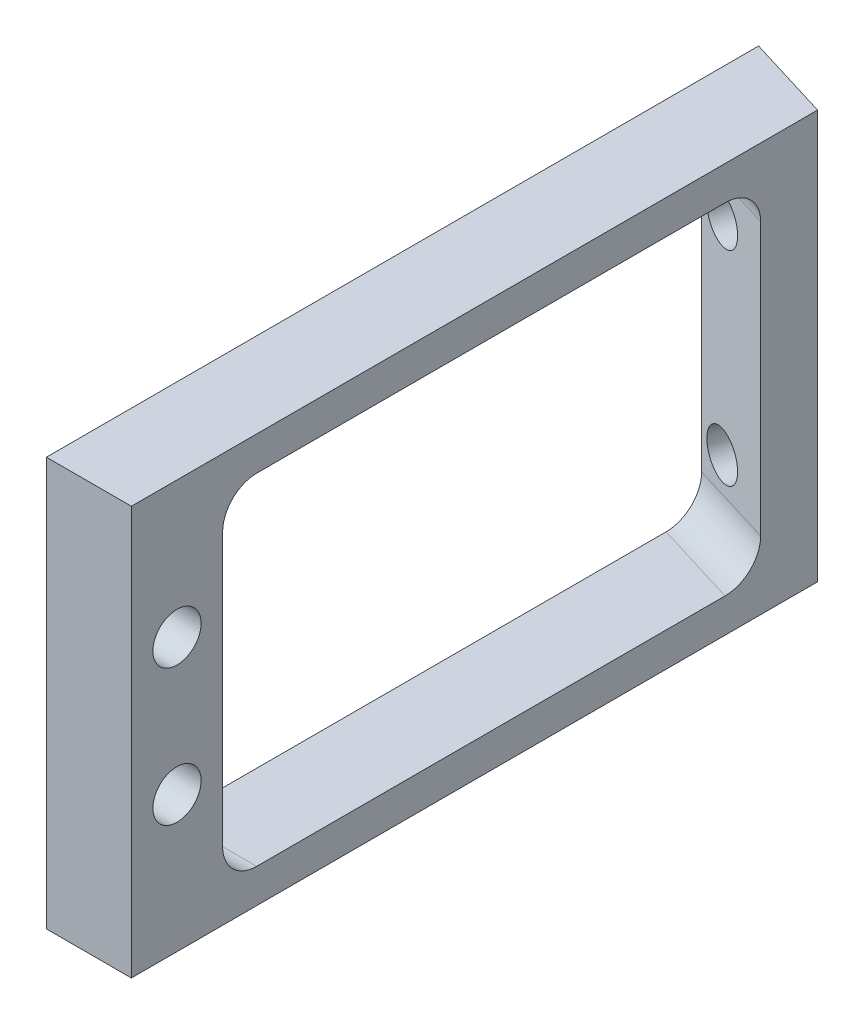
ISO-10303-21;
HEADER;
FILE_DESCRIPTION(('STEP AP214'),'2;1');
FILE_NAME('part.step','',(''),(''),'','','');
FILE_SCHEMA(('AUTOMOTIVE_DESIGN { 1 0 10303 214 1 1 1 1 }'));
ENDSEC;
DATA;
#1=APPLICATION_CONTEXT('core data for automotive mechanical design processes');
#2=APPLICATION_PROTOCOL_DEFINITION('international standard','automotive_design',2000,#1);
#3=PRODUCT_CONTEXT('',#1,'mechanical');
#4=PRODUCT('Part','Part','',(#3));
#5=PRODUCT_RELATED_PRODUCT_CATEGORY('part','',(#4));
#6=PRODUCT_DEFINITION_FORMATION('','',#4);
#7=PRODUCT_DEFINITION_CONTEXT('part definition',#1,'design');
#8=PRODUCT_DEFINITION('design','',#6,#7);
#9=PRODUCT_DEFINITION_SHAPE('','',#8);
#10=(LENGTH_UNIT() NAMED_UNIT(*) SI_UNIT(.MILLI.,.METRE.));
#11=(NAMED_UNIT(*) PLANE_ANGLE_UNIT() SI_UNIT($,.RADIAN.));
#12=(NAMED_UNIT(*) SI_UNIT($,.STERADIAN.) SOLID_ANGLE_UNIT());
#13=UNCERTAINTY_MEASURE_WITH_UNIT(LENGTH_MEASURE(1.E-05),#10,'distance_accuracy_value','');
#14=(GEOMETRIC_REPRESENTATION_CONTEXT(3) GLOBAL_UNCERTAINTY_ASSIGNED_CONTEXT((#13)) GLOBAL_UNIT_ASSIGNED_CONTEXT((#10,
#11,#12)) REPRESENTATION_CONTEXT('',''));
#15=CARTESIAN_POINT('',(0.,0.,0.));
#16=DIRECTION('',(0.,0.,1.));
#17=DIRECTION('',(1.,0.,0.));
#18=AXIS2_PLACEMENT_3D('',#15,#16,#17);
#19=CARTESIAN_POINT('',(7.9248,19.05,66.421));
#20=DIRECTION('',(1.,0.,0.));
#21=DIRECTION('',(0.,0.,-1.));
#22=AXIS2_PLACEMENT_3D('',#19,#20,#21);
#23=PLANE('',#22);
#24=CARTESIAN_POINT('',(7.9248,6.35,62.1665));
#25=DIRECTION('',(-1.,0.,0.));
#26=DIRECTION('',(0.,0.,1.));
#27=AXIS2_PLACEMENT_3D('',#24,#25,#26);
#28=CIRCLE('',#27,2.2479);
#29=CARTESIAN_POINT('',(7.9248,6.35,64.4144));
#30=VERTEX_POINT('',#29);
#31=EDGE_CURVE('E271',#30,#30,#28,.T.);
#32=ORIENTED_EDGE('',*,*,#31,.T.);
#33=EDGE_LOOP('',(#32));
#34=FACE_BOUND('',#33,.T.);
#35=CARTESIAN_POINT('',(7.9248,-6.35,62.1665));
#36=DIRECTION('',(-1.,0.,0.));
#37=DIRECTION('',(0.,0.,1.));
#38=AXIS2_PLACEMENT_3D('',#35,#36,#37);
#39=CIRCLE('',#38,2.2479);
#40=CARTESIAN_POINT('',(7.9248,-6.35,64.4144));
#41=VERTEX_POINT('',#40);
#42=EDGE_CURVE('E262',#41,#41,#39,.T.);
#43=ORIENTED_EDGE('',*,*,#42,.T.);
#44=EDGE_LOOP('',(#43));
#45=FACE_BOUND('',#44,.T.);
#46=DIRECTION('',(0.,1.,0.));
#47=VECTOR('',#46,1.);
#48=CARTESIAN_POINT('',(7.9248,-19.05,2.42285450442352));
#49=LINE('',#48,#47);
#50=CARTESIAN_POINT('',(7.9248,-19.05,2.42285450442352));
#51=VERTEX_POINT('',#50);
#52=CARTESIAN_POINT('',(7.9248,19.05,2.42285450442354));
#53=VERTEX_POINT('',#52);
#54=EDGE_CURVE('E104',#51,#53,#49,.T.);
#55=ORIENTED_EDGE('',*,*,#54,.T.);
#56=DIRECTION('',(0.,0.,1.));
#57=VECTOR('',#56,1.);
#58=CARTESIAN_POINT('',(7.9248,19.05,66.421));
#59=LINE('',#58,#57);
#60=CARTESIAN_POINT('',(7.9248,19.05,66.421));
#61=VERTEX_POINT('',#60);
#62=EDGE_CURVE('E59',#53,#61,#59,.T.);
#63=ORIENTED_EDGE('',*,*,#62,.T.);
#64=DIRECTION('',(0.,-1.,0.));
#65=VECTOR('',#64,1.);
#66=CARTESIAN_POINT('',(7.9248,19.05,66.421));
#67=LINE('',#66,#65);
#68=CARTESIAN_POINT('',(7.9248,-19.05,66.421));
#69=VERTEX_POINT('',#68);
#70=EDGE_CURVE('E91',#61,#69,#67,.T.);
#71=ORIENTED_EDGE('',*,*,#70,.T.);
#72=DIRECTION('',(0.,0.,-1.));
#73=VECTOR('',#72,1.);
#74=CARTESIAN_POINT('',(7.9248,-19.05,66.421));
#75=LINE('',#74,#73);
#76=EDGE_CURVE('E211',#69,#51,#75,.T.);
#77=ORIENTED_EDGE('',*,*,#76,.T.);
#78=EDGE_LOOP('',(#55,#63,#71,#77));
#79=FACE_BOUND('',#78,.T.);
#80=CARTESIAN_POINT('',(7.9248,-12.7,11.055039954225));
#81=DIRECTION('',(1.,0.,0.));
#82=DIRECTION('',(0.,0.,-1.));
#83=AXIS2_PLACEMENT_3D('',#80,#81,#82);
#84=ELLIPSE('',#83,3.3200713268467,3.175);
#85=CARTESIAN_POINT('',(7.9248,-12.7,7.73496862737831));
#86=VERTEX_POINT('',#85);
#87=CARTESIAN_POINT('',(7.9248,-15.875,11.055039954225));
#88=VERTEX_POINT('',#87);
#89=EDGE_CURVE('E158',#86,#88,#84,.F.);
#90=ORIENTED_EDGE('',*,*,#89,.T.);
#91=DIRECTION('',(0.,0.,1.));
#92=VECTOR('',#91,1.);
#93=CARTESIAN_POINT('',(7.9248,-15.875,11.303));
#94=LINE('',#93,#92);
#95=CARTESIAN_POINT('',(7.9248,-15.875,54.737));
#96=VERTEX_POINT('',#95);
#97=EDGE_CURVE('E162',#88,#96,#94,.T.);
#98=ORIENTED_EDGE('',*,*,#97,.T.);
#99=CARTESIAN_POINT('',(7.9248,-12.7,54.737));
#100=DIRECTION('',(-1.,0.,0.));
#101=DIRECTION('',(0.,0.,1.));
#102=AXIS2_PLACEMENT_3D('',#99,#100,#101);
#103=CIRCLE('',#102,3.17499999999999);
#104=CARTESIAN_POINT('',(7.9248,-12.7,57.912));
#105=VERTEX_POINT('',#104);
#106=EDGE_CURVE('E165',#96,#105,#103,.T.);
#107=ORIENTED_EDGE('',*,*,#106,.T.);
#108=DIRECTION('',(0.,1.,0.));
#109=VECTOR('',#108,1.);
#110=CARTESIAN_POINT('',(7.9248,12.7,57.912));
#111=LINE('',#110,#109);
#112=CARTESIAN_POINT('',(7.9248,12.7,57.912));
#113=VERTEX_POINT('',#112);
#114=EDGE_CURVE('E169',#105,#113,#111,.T.);
#115=ORIENTED_EDGE('',*,*,#114,.T.);
#116=CARTESIAN_POINT('',(7.9248,12.7,54.737));
#117=DIRECTION('',(-1.,0.,0.));
#118=DIRECTION('',(0.,0.,-1.));
#119=AXIS2_PLACEMENT_3D('',#116,#117,#118);
#120=CIRCLE('',#119,3.17499999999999);
#121=CARTESIAN_POINT('',(7.9248,15.875,54.737));
#122=VERTEX_POINT('',#121);
#123=EDGE_CURVE('E172',#113,#122,#120,.T.);
#124=ORIENTED_EDGE('',*,*,#123,.T.);
#125=DIRECTION('',(0.,0.,-1.));
#126=VECTOR('',#125,1.);
#127=CARTESIAN_POINT('',(7.9248,15.875,11.303));
#128=LINE('',#127,#126);
#129=CARTESIAN_POINT('',(7.9248,15.875,11.055039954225));
#130=VERTEX_POINT('',#129);
#131=EDGE_CURVE('E175',#122,#130,#128,.T.);
#132=ORIENTED_EDGE('',*,*,#131,.T.);
#133=CARTESIAN_POINT('',(7.9248,12.7,11.055039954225));
#134=DIRECTION('',(1.,0.,0.));
#135=DIRECTION('',(0.,0.,-1.));
#136=AXIS2_PLACEMENT_3D('',#133,#134,#135);
#137=ELLIPSE('',#136,3.3200713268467,3.175);
#138=CARTESIAN_POINT('',(7.9248,12.7,7.73496862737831));
#139=VERTEX_POINT('',#138);
#140=EDGE_CURVE('E151',#130,#139,#137,.F.);
#141=ORIENTED_EDGE('',*,*,#140,.T.);
#142=DIRECTION('',(0.,-1.,0.));
#143=VECTOR('',#142,1.);
#144=CARTESIAN_POINT('',(7.9248,19.05,7.7349686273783));
#145=LINE('',#144,#143);
#146=EDGE_CURVE('E145',#139,#86,#145,.T.);
#147=ORIENTED_EDGE('',*,*,#146,.T.);
#148=EDGE_LOOP('',(#90,#98,#107,#115,#124,#132,#141,#147));
#149=FACE_BOUND('',#148,.T.);
#150=ADVANCED_FACE('F42',(#34,#45,#79,#149),#23,.T.);
#151=CARTESIAN_POINT('',(0.,19.05,66.421));
#152=DIRECTION('',(1.,0.,0.));
#153=DIRECTION('',(0.,0.,-1.));
#154=AXIS2_PLACEMENT_3D('',#151,#152,#153);
#155=PLANE('',#154);
#156=CARTESIAN_POINT('',(0.,6.35,62.1665));
#157=DIRECTION('',(-1.,0.,0.));
#158=DIRECTION('',(0.,0.,1.));
#159=AXIS2_PLACEMENT_3D('',#156,#157,#158);
#160=CIRCLE('',#159,2.24789999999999);
#161=CARTESIAN_POINT('',(0.,6.35,64.4144));
#162=VERTEX_POINT('',#161);
#163=EDGE_CURVE('E274',#162,#162,#160,.T.);
#164=ORIENTED_EDGE('',*,*,#163,.F.);
#165=EDGE_LOOP('',(#164));
#166=FACE_BOUND('',#165,.T.);
#167=CARTESIAN_POINT('',(0.,-6.35,62.1665));
#168=DIRECTION('',(-1.,0.,0.));
#169=DIRECTION('',(0.,0.,1.));
#170=AXIS2_PLACEMENT_3D('',#167,#168,#169);
#171=CIRCLE('',#170,2.24789999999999);
#172=CARTESIAN_POINT('',(0.,-6.35,64.4144));
#173=VERTEX_POINT('',#172);
#174=EDGE_CURVE('E265',#173,#173,#171,.T.);
#175=ORIENTED_EDGE('',*,*,#174,.F.);
#176=EDGE_LOOP('',(#175));
#177=FACE_BOUND('',#176,.T.);
#178=DIRECTION('',(0.,-1.,0.));
#179=VECTOR('',#178,1.);
#180=CARTESIAN_POINT('',(0.,19.05,66.421));
#181=LINE('',#180,#179);
#182=CARTESIAN_POINT('',(0.,19.05,66.421));
#183=VERTEX_POINT('',#182);
#184=CARTESIAN_POINT('',(0.,-19.05,66.421));
#185=VERTEX_POINT('',#184);
#186=EDGE_CURVE('E97',#183,#185,#181,.T.);
#187=ORIENTED_EDGE('',*,*,#186,.F.);
#188=DIRECTION('',(0.,0.,1.));
#189=VECTOR('',#188,1.);
#190=CARTESIAN_POINT('',(0.,19.05,66.421));
#191=LINE('',#190,#189);
#192=CARTESIAN_POINT('',(0.,19.05,0.));
#193=VERTEX_POINT('',#192);
#194=EDGE_CURVE('E80',#193,#183,#191,.T.);
#195=ORIENTED_EDGE('',*,*,#194,.F.);
#196=DIRECTION('',(0.,1.,0.));
#197=VECTOR('',#196,1.);
#198=CARTESIAN_POINT('',(0.,19.05,0.));
#199=LINE('',#198,#197);
#200=CARTESIAN_POINT('',(0.,-19.05,0.));
#201=VERTEX_POINT('',#200);
#202=EDGE_CURVE('E92',#201,#193,#199,.T.);
#203=ORIENTED_EDGE('',*,*,#202,.F.);
#204=DIRECTION('',(0.,0.,-1.));
#205=VECTOR('',#204,1.);
#206=CARTESIAN_POINT('',(0.,-19.05,66.421));
#207=LINE('',#206,#205);
#208=EDGE_CURVE('E102',#185,#201,#207,.T.);
#209=ORIENTED_EDGE('',*,*,#208,.F.);
#210=EDGE_LOOP('',(#187,#195,#203,#209));
#211=FACE_BOUND('',#210,.T.);
#212=DIRECTION('',(0.,0.,1.));
#213=VECTOR('',#212,1.);
#214=CARTESIAN_POINT('',(0.,-15.875,11.303));
#215=LINE('',#214,#213);
#216=CARTESIAN_POINT('',(0.,-15.875,8.63218544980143));
#217=VERTEX_POINT('',#216);
#218=CARTESIAN_POINT('',(0.,-15.875,54.737));
#219=VERTEX_POINT('',#218);
#220=EDGE_CURVE('E161',#217,#219,#215,.T.);
#221=ORIENTED_EDGE('',*,*,#220,.F.);
#222=CARTESIAN_POINT('',(0.,-12.7,8.6321854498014));
#223=DIRECTION('',(1.,0.,0.));
#224=DIRECTION('',(0.,0.,-1.));
#225=AXIS2_PLACEMENT_3D('',#222,#223,#224);
#226=ELLIPSE('',#225,3.3200713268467,3.175);
#227=CARTESIAN_POINT('',(0.,-12.7,5.31211412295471));
#228=VERTEX_POINT('',#227);
#229=EDGE_CURVE('E13',#228,#217,#226,.F.);
#230=ORIENTED_EDGE('',*,*,#229,.F.);
#231=DIRECTION('',(0.,-1.,0.));
#232=VECTOR('',#231,1.);
#233=CARTESIAN_POINT('',(0.,19.05,5.3121141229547));
#234=LINE('',#233,#232);
#235=CARTESIAN_POINT('',(0.,12.7,5.31211412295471));
#236=VERTEX_POINT('',#235);
#237=EDGE_CURVE('E142',#236,#228,#234,.T.);
#238=ORIENTED_EDGE('',*,*,#237,.F.);
#239=CARTESIAN_POINT('',(0.,12.7,8.6321854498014));
#240=DIRECTION('',(1.,0.,0.));
#241=DIRECTION('',(0.,0.,-1.));
#242=AXIS2_PLACEMENT_3D('',#239,#240,#241);
#243=ELLIPSE('',#242,3.3200713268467,3.175);
#244=CARTESIAN_POINT('',(0.,15.875,8.63218544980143));
#245=VERTEX_POINT('',#244);
#246=EDGE_CURVE('E51',#245,#236,#243,.F.);
#247=ORIENTED_EDGE('',*,*,#246,.F.);
#248=DIRECTION('',(0.,0.,-1.));
#249=VECTOR('',#248,1.);
#250=CARTESIAN_POINT('',(0.,15.875,11.303));
#251=LINE('',#250,#249);
#252=CARTESIAN_POINT('',(0.,15.875,54.737));
#253=VERTEX_POINT('',#252);
#254=EDGE_CURVE('E166',#253,#245,#251,.T.);
#255=ORIENTED_EDGE('',*,*,#254,.F.);
#256=CARTESIAN_POINT('',(0.,12.7,54.737));
#257=DIRECTION('',(-1.,0.,0.));
#258=DIRECTION('',(0.,0.,-1.));
#259=AXIS2_PLACEMENT_3D('',#256,#257,#258);
#260=CIRCLE('',#259,3.17499999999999);
#261=CARTESIAN_POINT('',(0.,12.7,57.912));
#262=VERTEX_POINT('',#261);
#263=EDGE_CURVE('E187',#262,#253,#260,.T.);
#264=ORIENTED_EDGE('',*,*,#263,.F.);
#265=DIRECTION('',(0.,1.,0.));
#266=VECTOR('',#265,1.);
#267=CARTESIAN_POINT('',(0.,12.7,57.912));
#268=LINE('',#267,#266);
#269=CARTESIAN_POINT('',(0.,-12.7,57.912));
#270=VERTEX_POINT('',#269);
#271=EDGE_CURVE('E184',#270,#262,#268,.T.);
#272=ORIENTED_EDGE('',*,*,#271,.F.);
#273=CARTESIAN_POINT('',(0.,-12.7,54.737));
#274=DIRECTION('',(-1.,0.,0.));
#275=DIRECTION('',(0.,0.,1.));
#276=AXIS2_PLACEMENT_3D('',#273,#274,#275);
#277=CIRCLE('',#276,3.17499999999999);
#278=EDGE_CURVE('E181',#219,#270,#277,.T.);
#279=ORIENTED_EDGE('',*,*,#278,.F.);
#280=EDGE_LOOP('',(#221,#230,#238,#247,#255,#264,#272,#279));
#281=FACE_BOUND('',#280,.T.);
#282=ADVANCED_FACE('F100',(#166,#177,#211,#281),#155,.F.);
#283=CARTESIAN_POINT('',(-14.3203012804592,9.52500000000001,62.042844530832));
#284=DIRECTION('',(0.29237170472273,0.,-0.956304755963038));
#285=DIRECTION('',(-0.956304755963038,0.,-0.29237170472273));
#286=AXIS2_PLACEMENT_3D('',#283,#284,#285);
#287=CYLINDRICAL_SURFACE('',#286,2.159);
#288=CARTESIAN_POINT('',(4.2507746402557,9.52500000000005,1.29959222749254));
#289=DIRECTION('',(0.29237170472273,0.,-0.956304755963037));
#290=DIRECTION('',(-0.956304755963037,0.,-0.29237170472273));
#291=AXIS2_PLACEMENT_3D('',#288,#289,#290);
#292=CIRCLE('',#291,2.159);
#293=CARTESIAN_POINT('',(2.18611267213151,9.52500000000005,0.668361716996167));
#294=VERTEX_POINT('',#293);
#295=EDGE_CURVE('E206',#294,#294,#292,.T.);
#296=ORIENTED_EDGE('',*,*,#295,.T.);
#297=EDGE_LOOP('',(#296));
#298=FACE_BOUND('',#297,.T.);
#299=CARTESIAN_POINT('',(2.76552638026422,9.52500000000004,6.15762038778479));
#300=DIRECTION('',(-0.292371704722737,0.,0.956304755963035));
#301=DIRECTION('',(0.956304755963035,0.,0.292371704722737));
#302=AXIS2_PLACEMENT_3D('',#299,#300,#301);
#303=CIRCLE('',#302,2.159);
#304=CARTESIAN_POINT('',(4.83018834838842,9.52500000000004,6.78885089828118));
#305=VERTEX_POINT('',#304);
#306=EDGE_CURVE('E115',#305,#305,#303,.F.);
#307=ORIENTED_EDGE('',*,*,#306,.F.);
#308=EDGE_LOOP('',(#307));
#309=FACE_BOUND('',#308,.T.);
#310=ADVANCED_FACE('F282',(#298,#309),#287,.F.);
#311=CARTESIAN_POINT('',(-14.3203012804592,-9.52499999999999,62.042844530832));
#312=DIRECTION('',(0.29237170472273,0.,-0.956304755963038));
#313=DIRECTION('',(-0.956304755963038,0.,-0.29237170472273));
#314=AXIS2_PLACEMENT_3D('',#311,#312,#313);
#315=CYLINDRICAL_SURFACE('',#314,2.159);
#316=CARTESIAN_POINT('',(4.2507746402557,-9.52499999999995,1.29959222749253));
#317=DIRECTION('',(0.29237170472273,0.,-0.956304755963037));
#318=DIRECTION('',(-0.956304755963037,0.,-0.29237170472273));
#319=AXIS2_PLACEMENT_3D('',#316,#317,#318);
#320=CIRCLE('',#319,2.159);
#321=CARTESIAN_POINT('',(2.18611267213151,-9.52499999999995,0.668361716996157));
#322=VERTEX_POINT('',#321);
#323=EDGE_CURVE('E195',#322,#322,#320,.T.);
#324=ORIENTED_EDGE('',*,*,#323,.T.);
#325=EDGE_LOOP('',(#324));
#326=FACE_BOUND('',#325,.T.);
#327=CARTESIAN_POINT('',(2.76552638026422,-9.52499999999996,6.1576203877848));
#328=DIRECTION('',(-0.292371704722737,0.,0.956304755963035));
#329=DIRECTION('',(0.956304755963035,0.,0.292371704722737));
#330=AXIS2_PLACEMENT_3D('',#327,#328,#329);
#331=CIRCLE('',#330,2.159);
#332=CARTESIAN_POINT('',(4.83018834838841,-9.52499999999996,6.78885089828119));
#333=VERTEX_POINT('',#332);
#334=EDGE_CURVE('E113',#333,#333,#331,.F.);
#335=ORIENTED_EDGE('',*,*,#334,.F.);
#336=EDGE_LOOP('',(#335));
#337=FACE_BOUND('',#336,.T.);
#338=ADVANCED_FACE('F314',(#326,#337),#315,.F.);
#339=CARTESIAN_POINT('',(7.9248,19.05,66.421));
#340=DIRECTION('',(0.,0.,-1.));
#341=DIRECTION('',(0.,1.,0.));
#342=AXIS2_PLACEMENT_3D('',#339,#340,#341);
#343=PLANE('',#342);
#344=ORIENTED_EDGE('',*,*,#186,.T.);
#345=DIRECTION('',(-1.,0.,0.));
#346=VECTOR('',#345,1.);
#347=CARTESIAN_POINT('',(7.9248,-19.05,66.421));
#348=LINE('',#347,#346);
#349=EDGE_CURVE('E98',#69,#185,#348,.T.);
#350=ORIENTED_EDGE('',*,*,#349,.F.);
#351=ORIENTED_EDGE('',*,*,#70,.F.);
#352=DIRECTION('',(-1.,0.,0.));
#353=VECTOR('',#352,1.);
#354=CARTESIAN_POINT('',(7.9248,19.05,66.421));
#355=LINE('',#354,#353);
#356=EDGE_CURVE('E83',#61,#183,#355,.T.);
#357=ORIENTED_EDGE('',*,*,#356,.T.);
#358=EDGE_LOOP('',(#344,#350,#351,#357));
#359=FACE_BOUND('',#358,.T.);
#360=ADVANCED_FACE('F44',(#359),#343,.F.);
#361=CARTESIAN_POINT('',(7.9248,-19.05,66.421));
#362=DIRECTION('',(0.,1.,0.));
#363=DIRECTION('',(0.,0.,1.));
#364=AXIS2_PLACEMENT_3D('',#361,#362,#363);
#365=PLANE('',#364);
#366=ORIENTED_EDGE('',*,*,#208,.T.);
#367=DIRECTION('',(0.956304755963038,0.,0.29237170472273));
#368=VECTOR('',#367,1.);
#369=CARTESIAN_POINT('',(0.,-19.05,0.));
#370=LINE('',#369,#368);
#371=EDGE_CURVE('E74',#201,#51,#370,.T.);
#372=ORIENTED_EDGE('',*,*,#371,.T.);
#373=ORIENTED_EDGE('',*,*,#76,.F.);
#374=ORIENTED_EDGE('',*,*,#349,.T.);
#375=EDGE_LOOP('',(#366,#372,#373,#374));
#376=FACE_BOUND('',#375,.T.);
#377=ADVANCED_FACE('F217',(#376),#365,.F.);
#378=CARTESIAN_POINT('',(7.9248,19.05,66.421));
#379=DIRECTION('',(0.,-1.,0.));
#380=DIRECTION('',(0.,0.,-1.));
#381=AXIS2_PLACEMENT_3D('',#378,#379,#380);
#382=PLANE('',#381);
#383=ORIENTED_EDGE('',*,*,#62,.F.);
#384=DIRECTION('',(0.956304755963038,0.,0.29237170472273));
#385=VECTOR('',#384,1.);
#386=CARTESIAN_POINT('',(0.,19.05,0.));
#387=LINE('',#386,#385);
#388=EDGE_CURVE('E87',#193,#53,#387,.T.);
#389=ORIENTED_EDGE('',*,*,#388,.F.);
#390=ORIENTED_EDGE('',*,*,#194,.T.);
#391=ORIENTED_EDGE('',*,*,#356,.F.);
#392=EDGE_LOOP('',(#383,#389,#390,#391));
#393=FACE_BOUND('',#392,.T.);
#394=ADVANCED_FACE('F82',(#393),#382,.F.);
#395=CARTESIAN_POINT('',(0.,-19.05,0.));
#396=DIRECTION('',(-0.29237170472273,0.,0.956304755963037));
#397=DIRECTION('',(0.956304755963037,0.,0.29237170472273));
#398=AXIS2_PLACEMENT_3D('',#395,#396,#397);
#399=PLANE('',#398);
#400=ORIENTED_EDGE('',*,*,#323,.F.);
#401=EDGE_LOOP('',(#400));
#402=FACE_BOUND('',#401,.T.);
#403=ORIENTED_EDGE('',*,*,#295,.F.);
#404=EDGE_LOOP('',(#403));
#405=FACE_BOUND('',#404,.T.);
#406=ORIENTED_EDGE('',*,*,#388,.T.);
#407=ORIENTED_EDGE('',*,*,#54,.F.);
#408=ORIENTED_EDGE('',*,*,#371,.F.);
#409=ORIENTED_EDGE('',*,*,#202,.T.);
#410=EDGE_LOOP('',(#406,#407,#408,#409));
#411=FACE_BOUND('',#410,.T.);
#412=ADVANCED_FACE('F218',(#402,#405,#411),#399,.F.);
#413=CARTESIAN_POINT('',(7.9248,15.875,11.303));
#414=DIRECTION('',(0.,1.,0.));
#415=DIRECTION('',(0.,0.,1.));
#416=AXIS2_PLACEMENT_3D('',#413,#414,#415);
#417=PLANE('',#416);
#418=ORIENTED_EDGE('',*,*,#254,.T.);
#419=DIRECTION('',(-0.956304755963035,0.,-0.292371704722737));
#420=VECTOR('',#419,1.);
#421=CARTESIAN_POINT('',(23.4049259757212,15.875,15.7877894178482));
#422=LINE('',#421,#420);
#423=EDGE_CURVE('E131',#130,#245,#422,.T.);
#424=ORIENTED_EDGE('',*,*,#423,.F.);
#425=ORIENTED_EDGE('',*,*,#131,.F.);
#426=DIRECTION('',(-1.,0.,0.));
#427=VECTOR('',#426,1.);
#428=CARTESIAN_POINT('',(7.9248,15.875,54.737));
#429=LINE('',#428,#427);
#430=EDGE_CURVE('E192',#122,#253,#429,.T.);
#431=ORIENTED_EDGE('',*,*,#430,.T.);
#432=EDGE_LOOP('',(#418,#424,#425,#431));
#433=FACE_BOUND('',#432,.T.);
#434=ADVANCED_FACE('F261',(#433),#417,.F.);
#435=CARTESIAN_POINT('',(7.9248,12.7,54.737));
#436=DIRECTION('',(-1.,0.,0.));
#437=DIRECTION('',(0.,0.,1.));
#438=AXIS2_PLACEMENT_3D('',#435,#436,#437);
#439=CYLINDRICAL_SURFACE('',#438,3.17499999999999);
#440=ORIENTED_EDGE('',*,*,#263,.T.);
#441=ORIENTED_EDGE('',*,*,#430,.F.);
#442=ORIENTED_EDGE('',*,*,#123,.F.);
#443=DIRECTION('',(-1.,0.,0.));
#444=VECTOR('',#443,1.);
#445=CARTESIAN_POINT('',(7.9248,12.7,57.912));
#446=LINE('',#445,#444);
#447=EDGE_CURVE('E196',#113,#262,#446,.T.);
#448=ORIENTED_EDGE('',*,*,#447,.T.);
#449=EDGE_LOOP('',(#440,#441,#442,#448));
#450=FACE_BOUND('',#449,.T.);
#451=ADVANCED_FACE('F335',(#450),#439,.F.);
#452=CARTESIAN_POINT('',(7.9248,12.7,57.912));
#453=DIRECTION('',(0.,0.,1.));
#454=DIRECTION('',(1.,0.,0.));
#455=AXIS2_PLACEMENT_3D('',#452,#453,#454);
#456=PLANE('',#455);
#457=ORIENTED_EDGE('',*,*,#271,.T.);
#458=ORIENTED_EDGE('',*,*,#447,.F.);
#459=ORIENTED_EDGE('',*,*,#114,.F.);
#460=DIRECTION('',(-1.,0.,0.));
#461=VECTOR('',#460,1.);
#462=CARTESIAN_POINT('',(7.9248,-12.7,57.912));
#463=LINE('',#462,#461);
#464=EDGE_CURVE('E199',#105,#270,#463,.T.);
#465=ORIENTED_EDGE('',*,*,#464,.T.);
#466=EDGE_LOOP('',(#457,#458,#459,#465));
#467=FACE_BOUND('',#466,.T.);
#468=ADVANCED_FACE('F331',(#467),#456,.F.);
#469=CARTESIAN_POINT('',(7.9248,-12.7,54.737));
#470=DIRECTION('',(-1.,0.,0.));
#471=DIRECTION('',(0.,0.,1.));
#472=AXIS2_PLACEMENT_3D('',#469,#470,#471);
#473=CYLINDRICAL_SURFACE('',#472,3.17499999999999);
#474=ORIENTED_EDGE('',*,*,#278,.T.);
#475=ORIENTED_EDGE('',*,*,#464,.F.);
#476=ORIENTED_EDGE('',*,*,#106,.F.);
#477=DIRECTION('',(-1.,0.,0.));
#478=VECTOR('',#477,1.);
#479=CARTESIAN_POINT('',(7.9248,-15.875,54.737));
#480=LINE('',#479,#478);
#481=EDGE_CURVE('E178',#96,#219,#480,.T.);
#482=ORIENTED_EDGE('',*,*,#481,.T.);
#483=EDGE_LOOP('',(#474,#475,#476,#482));
#484=FACE_BOUND('',#483,.T.);
#485=ADVANCED_FACE('F328',(#484),#473,.F.);
#486=CARTESIAN_POINT('',(7.9248,-15.875,11.303));
#487=DIRECTION('',(0.,-1.,0.));
#488=DIRECTION('',(0.,0.,-1.));
#489=AXIS2_PLACEMENT_3D('',#486,#487,#488);
#490=PLANE('',#489);
#491=ORIENTED_EDGE('',*,*,#220,.T.);
#492=ORIENTED_EDGE('',*,*,#481,.F.);
#493=ORIENTED_EDGE('',*,*,#97,.F.);
#494=DIRECTION('',(-0.956304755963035,0.,-0.292371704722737));
#495=VECTOR('',#494,1.);
#496=CARTESIAN_POINT('',(23.4049259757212,-15.875,15.7877894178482));
#497=LINE('',#496,#495);
#498=EDGE_CURVE('E116',#88,#217,#497,.T.);
#499=ORIENTED_EDGE('',*,*,#498,.T.);
#500=EDGE_LOOP('',(#491,#492,#493,#499));
#501=FACE_BOUND('',#500,.T.);
#502=ADVANCED_FACE('F255',(#501),#490,.F.);
#503=CARTESIAN_POINT('',(23.4049259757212,-12.7,15.7877894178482));
#504=DIRECTION('',(-0.956304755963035,0.,-0.292371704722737));
#505=DIRECTION('',(-0.292371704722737,0.,0.956304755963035));
#506=AXIS2_PLACEMENT_3D('',#503,#504,#505);
#507=CYLINDRICAL_SURFACE('',#506,3.175);
#508=DIRECTION('',(-0.956304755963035,0.,-0.292371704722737));
#509=VECTOR('',#508,1.);
#510=CARTESIAN_POINT('',(24.3332061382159,-12.7,12.7515218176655));
#511=LINE('',#510,#509);
#512=EDGE_CURVE('E146',#86,#228,#511,.T.);
#513=ORIENTED_EDGE('',*,*,#512,.T.);
#514=ORIENTED_EDGE('',*,*,#229,.T.);
#515=ORIENTED_EDGE('',*,*,#498,.F.);
#516=ORIENTED_EDGE('',*,*,#89,.F.);
#517=EDGE_LOOP('',(#513,#514,#515,#516));
#518=FACE_BOUND('',#517,.T.);
#519=ADVANCED_FACE('F258',(#518),#507,.F.);
#520=CARTESIAN_POINT('',(23.4049259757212,12.7,15.7877894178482));
#521=DIRECTION('',(-0.956304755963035,0.,-0.292371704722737));
#522=DIRECTION('',(-0.292371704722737,0.,0.956304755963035));
#523=AXIS2_PLACEMENT_3D('',#520,#521,#522);
#524=CYLINDRICAL_SURFACE('',#523,3.175);
#525=ORIENTED_EDGE('',*,*,#423,.T.);
#526=ORIENTED_EDGE('',*,*,#246,.T.);
#527=DIRECTION('',(-0.956304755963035,0.,-0.292371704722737));
#528=VECTOR('',#527,1.);
#529=CARTESIAN_POINT('',(24.3332061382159,12.7,12.7515218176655));
#530=LINE('',#529,#528);
#531=EDGE_CURVE('E127',#139,#236,#530,.T.);
#532=ORIENTED_EDGE('',*,*,#531,.F.);
#533=ORIENTED_EDGE('',*,*,#140,.F.);
#534=EDGE_LOOP('',(#525,#526,#532,#533));
#535=FACE_BOUND('',#534,.T.);
#536=ADVANCED_FACE('F124',(#535),#524,.F.);
#537=CARTESIAN_POINT('',(24.3332061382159,-12.7,12.7515218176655));
#538=DIRECTION('',(-0.292371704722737,0.,0.956304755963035));
#539=DIRECTION('',(0.956304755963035,0.,0.292371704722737));
#540=AXIS2_PLACEMENT_3D('',#537,#538,#539);
#541=PLANE('',#540);
#542=ORIENTED_EDGE('',*,*,#306,.T.);
#543=EDGE_LOOP('',(#542));
#544=FACE_BOUND('',#543,.T.);
#545=ORIENTED_EDGE('',*,*,#334,.T.);
#546=EDGE_LOOP('',(#545));
#547=FACE_BOUND('',#546,.T.);
#548=ORIENTED_EDGE('',*,*,#531,.T.);
#549=ORIENTED_EDGE('',*,*,#237,.T.);
#550=ORIENTED_EDGE('',*,*,#512,.F.);
#551=ORIENTED_EDGE('',*,*,#146,.F.);
#552=EDGE_LOOP('',(#548,#549,#550,#551));
#553=FACE_BOUND('',#552,.T.);
#554=ADVANCED_FACE('F139',(#544,#547,#553),#541,.T.);
#555=CARTESIAN_POINT('',(0.,-6.35,62.1665));
#556=DIRECTION('',(-1.,0.,0.));
#557=DIRECTION('',(0.,0.,1.));
#558=AXIS2_PLACEMENT_3D('',#555,#556,#557);
#559=CYLINDRICAL_SURFACE('',#558,2.24789999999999);
#560=ORIENTED_EDGE('',*,*,#42,.F.);
#561=EDGE_LOOP('',(#560));
#562=FACE_BOUND('',#561,.T.);
#563=ORIENTED_EDGE('',*,*,#174,.T.);
#564=EDGE_LOOP('',(#563));
#565=FACE_BOUND('',#564,.T.);
#566=ADVANCED_FACE('F286',(#562,#565),#559,.F.);
#567=CARTESIAN_POINT('',(0.,6.35,62.1665));
#568=DIRECTION('',(-1.,0.,0.));
#569=DIRECTION('',(0.,0.,1.));
#570=AXIS2_PLACEMENT_3D('',#567,#568,#569);
#571=CYLINDRICAL_SURFACE('',#570,2.24789999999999);
#572=ORIENTED_EDGE('',*,*,#31,.F.);
#573=EDGE_LOOP('',(#572));
#574=FACE_BOUND('',#573,.T.);
#575=ORIENTED_EDGE('',*,*,#163,.T.);
#576=EDGE_LOOP('',(#575));
#577=FACE_BOUND('',#576,.T.);
#578=ADVANCED_FACE('F278',(#574,#577),#571,.F.);
#579=CLOSED_SHELL('',(#150,#282,#310,#338,#360,#377,#394,#412,#434,#451,#468,#485,#502,#519,
#536,#554,#566,#578));
#580=MANIFOLD_SOLID_BREP('B2',#579);
#581=ADVANCED_BREP_SHAPE_REPRESENTATION('',(#18,#580),#14);
#582=SHAPE_DEFINITION_REPRESENTATION(#9,#581);
ENDSEC;
END-ISO-10303-21;
